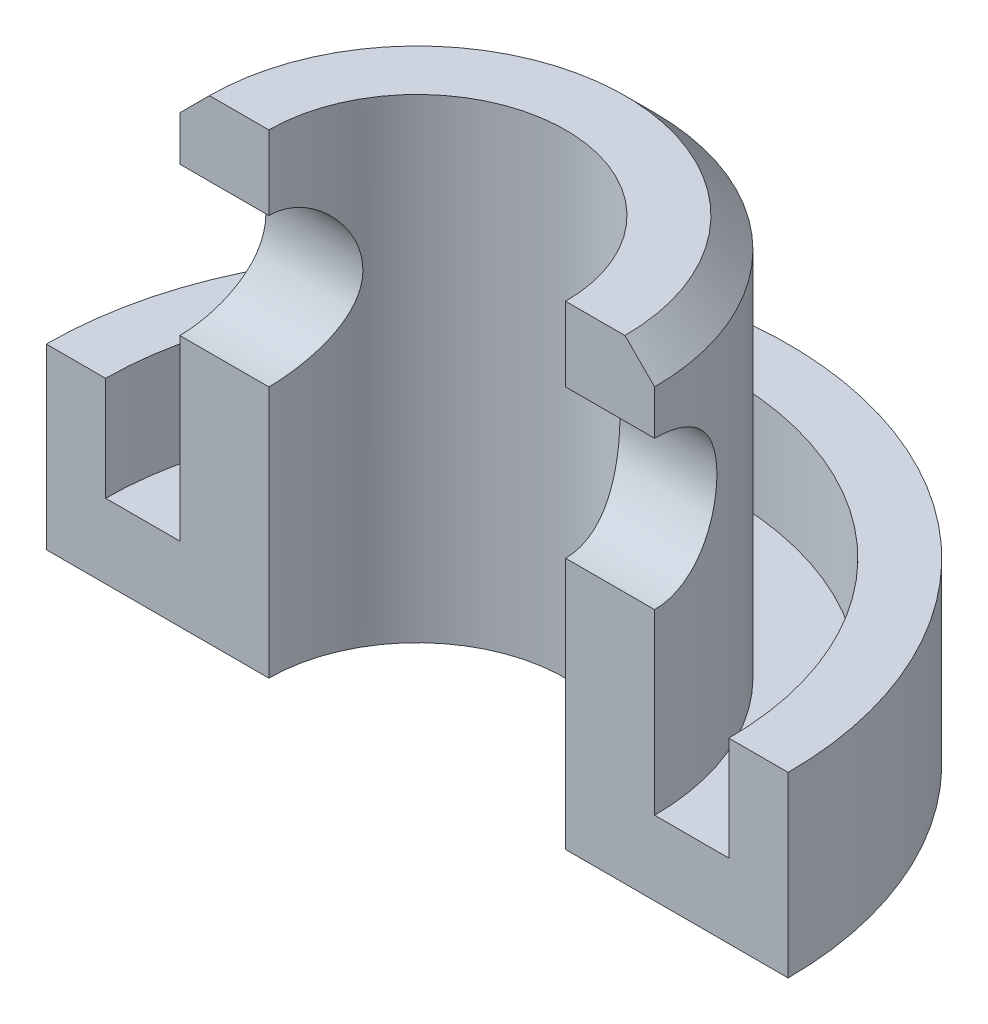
ISO-10303-21;
HEADER;
FILE_DESCRIPTION(('STEP AP214'),'2;1');
FILE_NAME('part.step','',(''),(''),'','','');
FILE_SCHEMA(('AUTOMOTIVE_DESIGN { 1 0 10303 214 1 1 1 1 }'));
ENDSEC;
DATA;
#1=APPLICATION_CONTEXT('core data for automotive mechanical design processes');
#2=APPLICATION_PROTOCOL_DEFINITION('international standard','automotive_design',2000,#1);
#3=PRODUCT_CONTEXT('',#1,'mechanical');
#4=PRODUCT('Part','Part','',(#3));
#5=PRODUCT_RELATED_PRODUCT_CATEGORY('part','',(#4));
#6=PRODUCT_DEFINITION_FORMATION('','',#4);
#7=PRODUCT_DEFINITION_CONTEXT('part definition',#1,'design');
#8=PRODUCT_DEFINITION('design','',#6,#7);
#9=PRODUCT_DEFINITION_SHAPE('','',#8);
#10=(LENGTH_UNIT() NAMED_UNIT(*) SI_UNIT(.MILLI.,.METRE.));
#11=(NAMED_UNIT(*) PLANE_ANGLE_UNIT() SI_UNIT($,.RADIAN.));
#12=(NAMED_UNIT(*) SI_UNIT($,.STERADIAN.) SOLID_ANGLE_UNIT());
#13=UNCERTAINTY_MEASURE_WITH_UNIT(LENGTH_MEASURE(1.E-05),#10,'distance_accuracy_value','');
#14=(GEOMETRIC_REPRESENTATION_CONTEXT(3) GLOBAL_UNCERTAINTY_ASSIGNED_CONTEXT((#13)) GLOBAL_UNIT_ASSIGNED_CONTEXT((#10,
#11,#12)) REPRESENTATION_CONTEXT('',''));
#15=CARTESIAN_POINT('',(0.,0.,0.));
#16=DIRECTION('',(0.,0.,1.));
#17=DIRECTION('',(1.,0.,0.));
#18=AXIS2_PLACEMENT_3D('',#15,#16,#17);
#19=CARTESIAN_POINT('',(-28.7272249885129,169.018039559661,0.));
#20=DIRECTION('',(0.,0.,-1.));
#21=DIRECTION('',(-1.,0.,0.));
#22=AXIS2_PLACEMENT_3D('',#19,#20,#21);
#23=PLANE('',#22);
#24=DIRECTION('',(0.,-1.,0.));
#25=VECTOR('',#24,1.);
#26=CARTESIAN_POINT('',(16.,0.,0.));
#27=LINE('',#26,#25);
#28=CARTESIAN_POINT('',(16.,30.,0.));
#29=VERTEX_POINT('',#28);
#30=CARTESIAN_POINT('',(16.,27.,0.));
#31=VERTEX_POINT('',#30);
#32=EDGE_CURVE('E249',#29,#31,#27,.T.);
#33=ORIENTED_EDGE('',*,*,#32,.F.);
#34=DIRECTION('',(0.707106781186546,-0.707106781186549,0.));
#35=VECTOR('',#34,1.);
#36=CARTESIAN_POINT('',(0.,46.0000000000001,0.));
#37=LINE('',#36,#35);
#38=CARTESIAN_POINT('',(14.,32.,0.));
#39=VERTEX_POINT('',#38);
#40=EDGE_CURVE('E257',#39,#29,#37,.T.);
#41=ORIENTED_EDGE('',*,*,#40,.F.);
#42=DIRECTION('',(1.,0.,0.));
#43=VECTOR('',#42,1.);
#44=CARTESIAN_POINT('',(-14.,32.,0.));
#45=LINE('',#44,#43);
#46=CARTESIAN_POINT('',(9.99999999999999,32.,0.));
#47=VERTEX_POINT('',#46);
#48=EDGE_CURVE('E244',#47,#39,#45,.T.);
#49=ORIENTED_EDGE('',*,*,#48,.F.);
#50=DIRECTION('',(0.,-1.,0.));
#51=VECTOR('',#50,1.);
#52=CARTESIAN_POINT('',(9.99999999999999,0.,0.));
#53=LINE('',#52,#51);
#54=CARTESIAN_POINT('',(10.0000000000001,27.0000000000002,0.));
#55=VERTEX_POINT('',#54);
#56=EDGE_CURVE('E49',#55,#47,#53,.F.);
#57=ORIENTED_EDGE('',*,*,#56,.F.);
#58=DIRECTION('',(1.,0.,0.));
#59=VECTOR('',#58,1.);
#60=CARTESIAN_POINT('',(-25.,27.,0.));
#61=LINE('',#60,#59);
#62=EDGE_CURVE('E256',#31,#55,#61,.F.);
#63=ORIENTED_EDGE('',*,*,#62,.F.);
#64=EDGE_LOOP('',(#33,#41,#49,#57,#63));
#65=FACE_BOUND('',#64,.T.);
#66=ADVANCED_FACE('F26',(#65),#23,.F.);
#67=CARTESIAN_POINT('',(0.,0.,0.));
#68=DIRECTION('',(0.,-1.,0.));
#69=DIRECTION('',(0.,0.,-1.));
#70=AXIS2_PLACEMENT_3D('',#67,#68,#69);
#71=CYLINDRICAL_SURFACE('',#70,25.);
#72=CARTESIAN_POINT('',(0.,12.,0.));
#73=DIRECTION('',(0.,-1.,0.));
#74=DIRECTION('',(0.,0.,-1.));
#75=AXIS2_PLACEMENT_3D('',#72,#73,#74);
#76=CIRCLE('',#75,25.);
#77=CARTESIAN_POINT('',(-25.,12.,0.));
#78=VERTEX_POINT('',#77);
#79=CARTESIAN_POINT('',(25.,12.,0.));
#80=VERTEX_POINT('',#79);
#81=EDGE_CURVE('E130',#78,#80,#76,.T.);
#82=ORIENTED_EDGE('',*,*,#81,.T.);
#83=DIRECTION('',(0.,-1.,0.));
#84=VECTOR('',#83,1.);
#85=CARTESIAN_POINT('',(25.,0.,0.));
#86=LINE('',#85,#84);
#87=CARTESIAN_POINT('',(25.,0.,0.));
#88=VERTEX_POINT('',#87);
#89=EDGE_CURVE('E253',#80,#88,#86,.T.);
#90=ORIENTED_EDGE('',*,*,#89,.T.);
#91=CARTESIAN_POINT('',(0.,0.,0.));
#92=DIRECTION('',(0.,-1.,0.));
#93=DIRECTION('',(0.,0.,-1.));
#94=AXIS2_PLACEMENT_3D('',#91,#92,#93);
#95=CIRCLE('',#94,25.);
#96=CARTESIAN_POINT('',(-25.,0.,0.));
#97=VERTEX_POINT('',#96);
#98=EDGE_CURVE('E144',#97,#88,#95,.T.);
#99=ORIENTED_EDGE('',*,*,#98,.F.);
#100=DIRECTION('',(0.,-1.,0.));
#101=VECTOR('',#100,1.);
#102=CARTESIAN_POINT('',(-25.,0.,0.));
#103=LINE('',#102,#101);
#104=EDGE_CURVE('E234',#97,#78,#103,.F.);
#105=ORIENTED_EDGE('',*,*,#104,.T.);
#106=EDGE_LOOP('',(#82,#90,#99,#105));
#107=FACE_BOUND('',#106,.T.);
#108=ADVANCED_FACE('F28',(#107),#71,.T.);
#109=CARTESIAN_POINT('',(-25.,12.,0.));
#110=DIRECTION('',(0.,-1.,0.));
#111=DIRECTION('',(0.,0.,-1.));
#112=AXIS2_PLACEMENT_3D('',#109,#110,#111);
#113=PLANE('',#112);
#114=ORIENTED_EDGE('',*,*,#81,.F.);
#115=DIRECTION('',(1.,0.,0.));
#116=VECTOR('',#115,1.);
#117=CARTESIAN_POINT('',(-25.,12.,0.));
#118=LINE('',#117,#116);
#119=CARTESIAN_POINT('',(-21.,12.,0.));
#120=VERTEX_POINT('',#119);
#121=EDGE_CURVE('E231',#78,#120,#118,.T.);
#122=ORIENTED_EDGE('',*,*,#121,.T.);
#123=CARTESIAN_POINT('',(0.,12.,0.));
#124=DIRECTION('',(0.,-1.,0.));
#125=DIRECTION('',(0.,0.,-1.));
#126=AXIS2_PLACEMENT_3D('',#123,#124,#125);
#127=CIRCLE('',#126,21.);
#128=CARTESIAN_POINT('',(21.,12.,0.));
#129=VERTEX_POINT('',#128);
#130=EDGE_CURVE('E278',#120,#129,#127,.T.);
#131=ORIENTED_EDGE('',*,*,#130,.T.);
#132=EDGE_CURVE('E235',#129,#80,#118,.T.);
#133=ORIENTED_EDGE('',*,*,#132,.T.);
#134=EDGE_LOOP('',(#114,#122,#131,#133));
#135=FACE_BOUND('',#134,.T.);
#136=ADVANCED_FACE('F204',(#135),#113,.F.);
#137=CARTESIAN_POINT('',(0.,0.,0.));
#138=DIRECTION('',(0.,-1.,0.));
#139=DIRECTION('',(0.,0.,-1.));
#140=AXIS2_PLACEMENT_3D('',#137,#138,#139);
#141=CYLINDRICAL_SURFACE('',#140,21.);
#142=CARTESIAN_POINT('',(0.,5.,0.));
#143=DIRECTION('',(0.,-1.,0.));
#144=DIRECTION('',(0.,0.,-1.));
#145=AXIS2_PLACEMENT_3D('',#142,#143,#144);
#146=CIRCLE('',#145,21.);
#147=CARTESIAN_POINT('',(-21.,5.,0.));
#148=VERTEX_POINT('',#147);
#149=CARTESIAN_POINT('',(21.,5.,0.));
#150=VERTEX_POINT('',#149);
#151=EDGE_CURVE('E275',#148,#150,#146,.T.);
#152=ORIENTED_EDGE('',*,*,#151,.T.);
#153=DIRECTION('',(0.,-1.,0.));
#154=VECTOR('',#153,1.);
#155=CARTESIAN_POINT('',(21.,0.,0.));
#156=LINE('',#155,#154);
#157=EDGE_CURVE('E250',#150,#129,#156,.F.);
#158=ORIENTED_EDGE('',*,*,#157,.T.);
#159=ORIENTED_EDGE('',*,*,#130,.F.);
#160=DIRECTION('',(0.,-1.,0.));
#161=VECTOR('',#160,1.);
#162=CARTESIAN_POINT('',(-21.,0.,0.));
#163=LINE('',#162,#161);
#164=EDGE_CURVE('E227',#120,#148,#163,.T.);
#165=ORIENTED_EDGE('',*,*,#164,.T.);
#166=EDGE_LOOP('',(#152,#158,#159,#165));
#167=FACE_BOUND('',#166,.T.);
#168=ADVANCED_FACE('F288',(#167),#141,.F.);
#169=CARTESIAN_POINT('',(-21.,5.,0.));
#170=DIRECTION('',(0.,-1.,0.));
#171=DIRECTION('',(0.,0.,-1.));
#172=AXIS2_PLACEMENT_3D('',#169,#170,#171);
#173=PLANE('',#172);
#174=ORIENTED_EDGE('',*,*,#151,.F.);
#175=DIRECTION('',(1.,0.,0.));
#176=VECTOR('',#175,1.);
#177=CARTESIAN_POINT('',(-21.,5.,0.));
#178=LINE('',#177,#176);
#179=CARTESIAN_POINT('',(-16.,5.,0.));
#180=VERTEX_POINT('',#179);
#181=EDGE_CURVE('E140',#148,#180,#178,.T.);
#182=ORIENTED_EDGE('',*,*,#181,.T.);
#183=CARTESIAN_POINT('',(0.,5.,0.));
#184=DIRECTION('',(0.,-1.,0.));
#185=DIRECTION('',(0.,0.,-1.));
#186=AXIS2_PLACEMENT_3D('',#183,#184,#185);
#187=CIRCLE('',#186,16.);
#188=CARTESIAN_POINT('',(16.,5.,0.));
#189=VERTEX_POINT('',#188);
#190=EDGE_CURVE('E139',#180,#189,#187,.T.);
#191=ORIENTED_EDGE('',*,*,#190,.T.);
#192=EDGE_CURVE('E228',#189,#150,#178,.T.);
#193=ORIENTED_EDGE('',*,*,#192,.T.);
#194=EDGE_LOOP('',(#174,#182,#191,#193));
#195=FACE_BOUND('',#194,.T.);
#196=ADVANCED_FACE('F197',(#195),#173,.F.);
#197=CARTESIAN_POINT('',(0.,0.,0.));
#198=DIRECTION('',(0.,-1.,0.));
#199=DIRECTION('',(0.,0.,-1.));
#200=AXIS2_PLACEMENT_3D('',#197,#198,#199);
#201=CYLINDRICAL_SURFACE('',#200,16.);
#202=CARTESIAN_POINT('',(0.,30.,0.));
#203=DIRECTION('',(0.,-1.,0.));
#204=DIRECTION('',(0.,0.,-1.));
#205=AXIS2_PLACEMENT_3D('',#202,#203,#204);
#206=CIRCLE('',#205,16.);
#207=CARTESIAN_POINT('',(-16.,30.,0.));
#208=VERTEX_POINT('',#207);
#209=EDGE_CURVE('E270',#208,#29,#206,.T.);
#210=ORIENTED_EDGE('',*,*,#209,.T.);
#211=ORIENTED_EDGE('',*,*,#32,.T.);
#212=CARTESIAN_POINT('',(15.1986841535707,22.,-5.));
#213=CARTESIAN_POINT('',(15.1986858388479,21.7266118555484,-4.99999815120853));
#214=CARTESIAN_POINT('',(15.206141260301,21.4532049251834,-4.97750155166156));
#215=CARTESIAN_POINT('',(15.2350255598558,20.9144233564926,-4.8883670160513));
#216=CARTESIAN_POINT('',(15.2564582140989,20.6490509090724,-4.82171715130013));
#217=CARTESIAN_POINT('',(15.3106375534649,20.134220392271,-4.64679152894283));
#218=CARTESIAN_POINT('',(15.3433642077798,19.884735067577,-4.53858942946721));
#219=CARTESIAN_POINT('',(15.4164162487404,19.4073892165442,-4.28387656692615));
#220=CARTESIAN_POINT('',(15.4567429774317,19.1795325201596,-4.13735903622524));
#221=CARTESIAN_POINT('',(15.5420051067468,18.744084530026,-3.80478428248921));
#222=CARTESIAN_POINT('',(15.5870449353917,18.537345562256,-3.61763759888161));
#223=CARTESIAN_POINT('',(15.6757698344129,18.1576159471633,-3.21144818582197));
#224=CARTESIAN_POINT('',(15.7194547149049,17.9846300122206,-2.99240101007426));
#225=CARTESIAN_POINT('',(15.8017421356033,17.673555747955,-2.52250364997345));
#226=CARTESIAN_POINT('',(15.8402073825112,17.5363451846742,-2.27104622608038));
#227=CARTESIAN_POINT('',(15.9065020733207,17.3064958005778,-1.74721693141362));
#228=CARTESIAN_POINT('',(15.9343340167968,17.2138465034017,-1.47484999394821));
#229=CARTESIAN_POINT('',(15.9754870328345,17.0785954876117,-0.925857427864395));
#230=CARTESIAN_POINT('',(15.9892295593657,17.0345370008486,-0.649622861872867));
#231=CARTESIAN_POINT('',(16.0021438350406,16.9931026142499,-0.0933632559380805));
#232=CARTESIAN_POINT('',(16.0013188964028,16.9957161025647,0.186660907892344));
#233=CARTESIAN_POINT('',(15.9854846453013,17.0465931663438,0.732297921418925));
#234=CARTESIAN_POINT('',(15.9709660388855,17.093277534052,0.99807453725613));
#235=CARTESIAN_POINT('',(15.929979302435,17.2283799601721,1.51781225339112));
#236=CARTESIAN_POINT('',(15.9035103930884,17.3168007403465,1.77177258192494));
#237=CARTESIAN_POINT('',(15.8409383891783,17.5338807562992,2.26431241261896));
#238=CARTESIAN_POINT('',(15.8047213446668,17.663019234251,2.50266562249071));
#239=CARTESIAN_POINT('',(15.7264689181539,17.9574843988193,2.95481004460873));
#240=CARTESIAN_POINT('',(15.6844320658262,18.1228202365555,3.16859502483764));
#241=CARTESIAN_POINT('',(15.5969468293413,18.4930945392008,3.57495079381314));
#242=CARTESIAN_POINT('',(15.5514292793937,18.6993962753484,3.76626619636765));
#243=CARTESIAN_POINT('',(15.4636246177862,19.1415804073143,4.11195897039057));
#244=CARTESIAN_POINT('',(15.4213378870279,19.3774662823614,4.26633199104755));
#245=CARTESIAN_POINT('',(15.3444338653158,19.8756698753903,4.53521860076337));
#246=CARTESIAN_POINT('',(15.3099076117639,20.1382536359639,4.64926722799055));
#247=CARTESIAN_POINT('',(15.253501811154,20.680237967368,4.83113383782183));
#248=CARTESIAN_POINT('',(15.2316177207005,20.9596324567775,4.89896843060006));
#249=CARTESIAN_POINT('',(15.2039825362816,21.5152798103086,4.9840594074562));
#250=CARTESIAN_POINT('',(15.1976186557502,21.7912079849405,5.00323817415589));
#251=CARTESIAN_POINT('',(15.200043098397,22.3423589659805,4.99586977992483));
#252=CARTESIAN_POINT('',(15.2088290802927,22.6175818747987,4.96932968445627));
#253=CARTESIAN_POINT('',(15.2399582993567,23.1512331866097,4.87299494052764));
#254=CARTESIAN_POINT('',(15.2619021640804,23.4099170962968,4.80447324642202));
#255=CARTESIAN_POINT('',(15.3164514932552,23.9120871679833,4.62761494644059));
#256=CARTESIAN_POINT('',(15.3490586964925,24.1555708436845,4.51927184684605));
#257=CARTESIAN_POINT('',(15.4224215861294,24.6281564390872,4.26230042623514));
#258=CARTESIAN_POINT('',(15.4633841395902,24.8566456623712,4.11260589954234));
#259=CARTESIAN_POINT('',(15.5484139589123,25.2859613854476,3.77842563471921));
#260=CARTESIAN_POINT('',(15.5924820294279,25.4867806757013,3.59393085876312));
#261=CARTESIAN_POINT('',(15.6809675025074,25.8636414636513,3.18629179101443));
#262=CARTESIAN_POINT('',(15.7253236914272,26.0383111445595,2.96186259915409));
#263=CARTESIAN_POINT('',(15.8075623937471,26.347564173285,2.48580618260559));
#264=CARTESIAN_POINT('',(15.8454452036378,26.4821493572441,2.23418020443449));
#265=CARTESIAN_POINT('',(15.9102524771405,26.7061222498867,1.71242209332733));
#266=CARTESIAN_POINT('',(15.937255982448,26.7958371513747,1.44244073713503));
#267=CARTESIAN_POINT('',(15.9776097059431,26.9282901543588,0.890229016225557));
#268=CARTESIAN_POINT('',(15.9909641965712,26.971042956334,0.608002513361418));
#269=CARTESIAN_POINT('',(16.0022321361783,27.0071640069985,0.0519397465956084));
#270=CARTESIAN_POINT('',(16.0007651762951,27.0025138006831,-0.22175676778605));
#271=CARTESIAN_POINT('',(15.9840391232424,26.9487527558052,-0.764292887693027));
#272=CARTESIAN_POINT('',(15.9687809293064,26.899644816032,-1.03313280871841));
#273=CARTESIAN_POINT('',(15.9263828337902,26.7596239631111,-1.55502047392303));
#274=CARTESIAN_POINT('',(15.899393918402,26.6692415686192,-1.80822367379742));
#275=CARTESIAN_POINT('',(15.8363178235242,26.4497166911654,-2.29599370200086));
#276=CARTESIAN_POINT('',(15.8002290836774,26.3205675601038,-2.53055732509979));
#277=CARTESIAN_POINT('',(15.7211958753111,26.0221089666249,-2.98304677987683));
#278=CARTESIAN_POINT('',(15.6780603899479,25.851585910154,-3.20013842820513));
#279=CARTESIAN_POINT('',(15.590349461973,25.4773604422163,-3.6032831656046));
#280=CARTESIAN_POINT('',(15.5457735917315,25.2736481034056,-3.78932693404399));
#281=CARTESIAN_POINT('',(15.4584757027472,24.8307371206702,-4.13131463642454));
#282=CARTESIAN_POINT('',(15.4158640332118,24.5905863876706,-4.28605711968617));
#283=CARTESIAN_POINT('',(15.3392050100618,24.0864075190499,-4.5528188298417));
#284=CARTESIAN_POINT('',(15.3051541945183,23.8223890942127,-4.66485533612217));
#285=CARTESIAN_POINT('',(15.2522624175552,23.3011095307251,-4.83484721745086));
#286=CARTESIAN_POINT('',(15.2323726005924,23.0451898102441,-4.89659759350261));
#287=CARTESIAN_POINT('',(15.2055842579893,22.5261846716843,-4.97916983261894));
#288=CARTESIAN_POINT('',(15.1986825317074,22.2631010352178,-5.00000177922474));
#289=CARTESIAN_POINT('',(15.1986841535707,22.,-5.));
#290=B_SPLINE_CURVE_WITH_KNOTS('',3,(#212,#213,#214,#215,#216,#217,#218,#219,#220,#221,#222,
#223,#224,#225,#226,#227,#228,#229,#230,#231,#232,#233,#234,#235,#236,#237,#238,#239,#240,#241,
#242,#243,#244,#245,#246,#247,#248,#249,#250,#251,#252,#253,#254,#255,#256,#257,#258,#259,#260,
#261,#262,#263,#264,#265,#266,#267,#268,#269,#270,#271,#272,#273,#274,#275,#276,#277,#278,#279,
#280,#281,#282,#283,#284,#285,#286,#287,#288,#289),.UNSPECIFIED.,.T.,.F.,(4,2,2,2,2,2,2,2,2,2,2,
2,2,2,2,2,2,2,2,2,2,2,2,2,2,2,2,2,2,2,2,2,2,2,2,2,2,2,4),(0.,0.819192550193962,1.63860650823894,
2.45657457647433,3.27468721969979,4.11828322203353,4.96199691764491,5.82479287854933,
6.68738589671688,7.52334891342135,8.35912185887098,9.16603931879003,9.97300940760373,
10.7898561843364,11.6069097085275,12.4580135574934,13.309217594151,14.1699388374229,
15.0303505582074,15.8561973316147,16.6819164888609,17.4837588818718,18.2857320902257,
19.1107045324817,19.9358915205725,20.7952775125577,21.6546241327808,22.5076095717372,
23.3603279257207,24.1775520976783,24.9947229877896,25.8016738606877,26.6087631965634,
27.4432277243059,28.2779423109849,29.1403118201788,30.002332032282,30.7908941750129,
31.5792619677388),.UNSPECIFIED.);
#291=CARTESIAN_POINT('',(16.,17.,0.));
#292=VERTEX_POINT('',#291);
#293=EDGE_CURVE('E145',#31,#292,#290,.T.);
#294=ORIENTED_EDGE('',*,*,#293,.T.);
#295=EDGE_CURVE('E41',#292,#189,#27,.T.);
#296=ORIENTED_EDGE('',*,*,#295,.T.);
#297=ORIENTED_EDGE('',*,*,#190,.F.);
#298=DIRECTION('',(0.,-1.,0.));
#299=VECTOR('',#298,1.);
#300=CARTESIAN_POINT('',(-16.,0.,0.));
#301=LINE('',#300,#299);
#302=CARTESIAN_POINT('',(-16.,17.,0.));
#303=VERTEX_POINT('',#302);
#304=EDGE_CURVE('E122',#180,#303,#301,.F.);
#305=ORIENTED_EDGE('',*,*,#304,.T.);
#306=CARTESIAN_POINT('',(-15.1986841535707,22.,-5.));
#307=CARTESIAN_POINT('',(-15.1986858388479,22.2733881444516,-4.99999815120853));
#308=CARTESIAN_POINT('',(-15.206141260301,22.5467950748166,-4.97750155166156));
#309=CARTESIAN_POINT('',(-15.2350255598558,23.0855766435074,-4.8883670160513));
#310=CARTESIAN_POINT('',(-15.2564582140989,23.3509490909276,-4.82171715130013));
#311=CARTESIAN_POINT('',(-15.3106375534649,23.865779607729,-4.64679152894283));
#312=CARTESIAN_POINT('',(-15.3433642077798,24.115264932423,-4.53858942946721));
#313=CARTESIAN_POINT('',(-15.4164162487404,24.5926107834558,-4.28387656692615));
#314=CARTESIAN_POINT('',(-15.4567429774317,24.8204674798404,-4.13735903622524));
#315=CARTESIAN_POINT('',(-15.5420051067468,25.255915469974,-3.80478428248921));
#316=CARTESIAN_POINT('',(-15.5870449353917,25.462654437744,-3.61763759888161));
#317=CARTESIAN_POINT('',(-15.6757698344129,25.8423840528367,-3.21144818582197));
#318=CARTESIAN_POINT('',(-15.7194547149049,26.0153699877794,-2.99240101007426));
#319=CARTESIAN_POINT('',(-15.8017421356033,26.326444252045,-2.52250364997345));
#320=CARTESIAN_POINT('',(-15.8402073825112,26.4636548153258,-2.27104622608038));
#321=CARTESIAN_POINT('',(-15.9065020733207,26.6935041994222,-1.74721693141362));
#322=CARTESIAN_POINT('',(-15.9343340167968,26.7861534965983,-1.47484999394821));
#323=CARTESIAN_POINT('',(-15.9754870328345,26.9214045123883,-0.925857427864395));
#324=CARTESIAN_POINT('',(-15.9892295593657,26.9654629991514,-0.649622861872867));
#325=CARTESIAN_POINT('',(-16.0021438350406,27.0068973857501,-0.0933632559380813));
#326=CARTESIAN_POINT('',(-16.0013188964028,27.0042838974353,0.186660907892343));
#327=CARTESIAN_POINT('',(-15.9854846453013,26.9534068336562,0.732297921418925));
#328=CARTESIAN_POINT('',(-15.9709660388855,26.906722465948,0.99807453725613));
#329=CARTESIAN_POINT('',(-15.929979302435,26.7716200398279,1.51781225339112));
#330=CARTESIAN_POINT('',(-15.9035103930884,26.6831992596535,1.77177258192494));
#331=CARTESIAN_POINT('',(-15.8409383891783,26.4661192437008,2.26431241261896));
#332=CARTESIAN_POINT('',(-15.8047213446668,26.336980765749,2.50266562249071));
#333=CARTESIAN_POINT('',(-15.7264689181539,26.0425156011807,2.95481004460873));
#334=CARTESIAN_POINT('',(-15.6844320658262,25.8771797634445,3.16859502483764));
#335=CARTESIAN_POINT('',(-15.5969468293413,25.5069054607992,3.57495079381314));
#336=CARTESIAN_POINT('',(-15.5514292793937,25.3006037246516,3.76626619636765));
#337=CARTESIAN_POINT('',(-15.4636246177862,24.8584195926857,4.11195897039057));
#338=CARTESIAN_POINT('',(-15.4213378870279,24.6225337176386,4.26633199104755));
#339=CARTESIAN_POINT('',(-15.3444338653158,24.1243301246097,4.53521860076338));
#340=CARTESIAN_POINT('',(-15.3099076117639,23.8617463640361,4.64926722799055));
#341=CARTESIAN_POINT('',(-15.253501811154,23.319762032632,4.83113383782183));
#342=CARTESIAN_POINT('',(-15.2316177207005,23.0403675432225,4.89896843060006));
#343=CARTESIAN_POINT('',(-15.2039825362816,22.4847201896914,4.9840594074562));
#344=CARTESIAN_POINT('',(-15.1976186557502,22.2087920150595,5.00323817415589));
#345=CARTESIAN_POINT('',(-15.200043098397,21.6576410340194,4.99586977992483));
#346=CARTESIAN_POINT('',(-15.2088290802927,21.3824181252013,4.96932968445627));
#347=CARTESIAN_POINT('',(-15.2399582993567,20.8487668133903,4.87299494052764));
#348=CARTESIAN_POINT('',(-15.2619021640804,20.5900829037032,4.80447324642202));
#349=CARTESIAN_POINT('',(-15.3164514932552,20.0879128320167,4.62761494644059));
#350=CARTESIAN_POINT('',(-15.3490586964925,19.8444291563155,4.51927184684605));
#351=CARTESIAN_POINT('',(-15.4224215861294,19.3718435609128,4.26230042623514));
#352=CARTESIAN_POINT('',(-15.4633841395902,19.1433543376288,4.11260589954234));
#353=CARTESIAN_POINT('',(-15.5484139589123,18.7140386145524,3.77842563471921));
#354=CARTESIAN_POINT('',(-15.5924820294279,18.5132193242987,3.59393085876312));
#355=CARTESIAN_POINT('',(-15.6809675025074,18.1363585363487,3.18629179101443));
#356=CARTESIAN_POINT('',(-15.7253236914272,17.9616888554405,2.96186259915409));
#357=CARTESIAN_POINT('',(-15.8075623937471,17.652435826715,2.48580618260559));
#358=CARTESIAN_POINT('',(-15.8454452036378,17.5178506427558,2.23418020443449));
#359=CARTESIAN_POINT('',(-15.9102524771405,17.2938777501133,1.71242209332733));
#360=CARTESIAN_POINT('',(-15.937255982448,17.2041628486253,1.44244073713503));
#361=CARTESIAN_POINT('',(-15.9776097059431,17.0717098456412,0.890229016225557));
#362=CARTESIAN_POINT('',(-15.9909641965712,17.028957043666,0.608002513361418));
#363=CARTESIAN_POINT('',(-16.0022321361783,16.9928359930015,0.0519397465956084));
#364=CARTESIAN_POINT('',(-16.0007651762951,16.9974861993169,-0.22175676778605));
#365=CARTESIAN_POINT('',(-15.9840391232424,17.0512472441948,-0.764292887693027));
#366=CARTESIAN_POINT('',(-15.9687809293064,17.100355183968,-1.03313280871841));
#367=CARTESIAN_POINT('',(-15.9263828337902,17.2403760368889,-1.55502047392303));
#368=CARTESIAN_POINT('',(-15.899393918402,17.3307584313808,-1.80822367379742));
#369=CARTESIAN_POINT('',(-15.8363178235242,17.5502833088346,-2.29599370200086));
#370=CARTESIAN_POINT('',(-15.8002290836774,17.6794324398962,-2.53055732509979));
#371=CARTESIAN_POINT('',(-15.7211958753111,17.9778910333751,-2.98304677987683));
#372=CARTESIAN_POINT('',(-15.6780603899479,18.148414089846,-3.20013842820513));
#373=CARTESIAN_POINT('',(-15.590349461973,18.5226395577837,-3.6032831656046));
#374=CARTESIAN_POINT('',(-15.5457735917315,18.7263518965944,-3.78932693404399));
#375=CARTESIAN_POINT('',(-15.4584757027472,19.1692628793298,-4.13131463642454));
#376=CARTESIAN_POINT('',(-15.4158640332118,19.4094136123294,-4.28605711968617));
#377=CARTESIAN_POINT('',(-15.3392050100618,19.9135924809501,-4.5528188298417));
#378=CARTESIAN_POINT('',(-15.3051541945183,20.1776109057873,-4.66485533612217));
#379=CARTESIAN_POINT('',(-15.2522624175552,20.6988904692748,-4.83484721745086));
#380=CARTESIAN_POINT('',(-15.2323726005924,20.9548101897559,-4.89659759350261));
#381=CARTESIAN_POINT('',(-15.2055842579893,21.4738153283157,-4.97916983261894));
#382=CARTESIAN_POINT('',(-15.1986825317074,21.7368989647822,-5.00000177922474));
#383=CARTESIAN_POINT('',(-15.1986841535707,22.,-5.));
#384=B_SPLINE_CURVE_WITH_KNOTS('',3,(#306,#307,#308,#309,#310,#311,#312,#313,#314,#315,#316,
#317,#318,#319,#320,#321,#322,#323,#324,#325,#326,#327,#328,#329,#330,#331,#332,#333,#334,#335,
#336,#337,#338,#339,#340,#341,#342,#343,#344,#345,#346,#347,#348,#349,#350,#351,#352,#353,#354,
#355,#356,#357,#358,#359,#360,#361,#362,#363,#364,#365,#366,#367,#368,#369,#370,#371,#372,#373,
#374,#375,#376,#377,#378,#379,#380,#381,#382,#383),.UNSPECIFIED.,.T.,.F.,(4,2,2,2,2,2,2,2,2,2,2,
2,2,2,2,2,2,2,2,2,2,2,2,2,2,2,2,2,2,2,2,2,2,2,2,2,2,2,4),(0.,0.819192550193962,1.63860650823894,
2.45657457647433,3.27468721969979,4.11828322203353,4.96199691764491,5.82479287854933,
6.68738589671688,7.52334891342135,8.35912185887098,9.16603931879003,9.97300940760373,
10.7898561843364,11.6069097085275,12.4580135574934,13.309217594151,14.1699388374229,
15.0303505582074,15.8561973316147,16.6819164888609,17.4837588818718,18.2857320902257,
19.1107045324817,19.9358915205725,20.7952775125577,21.6546241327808,22.5076095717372,
23.3603279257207,24.1775520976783,24.9947229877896,25.8016738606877,26.6087631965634,
27.4432277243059,28.2779423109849,29.1403118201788,30.002332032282,30.7908941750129,
31.5792619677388),.UNSPECIFIED.);
#385=CARTESIAN_POINT('',(-16.,27.,0.));
#386=VERTEX_POINT('',#385);
#387=EDGE_CURVE('E137',#303,#386,#384,.T.);
#388=ORIENTED_EDGE('',*,*,#387,.T.);
#389=EDGE_CURVE('E142',#386,#208,#301,.F.);
#390=ORIENTED_EDGE('',*,*,#389,.T.);
#391=EDGE_LOOP('',(#210,#211,#294,#296,#297,#305,#388,#390));
#392=FACE_BOUND('',#391,.T.);
#393=ADVANCED_FACE('F135',(#392),#201,.T.);
#394=CARTESIAN_POINT('',(0.,32.,0.));
#395=DIRECTION('',(0.,-1.,0.));
#396=DIRECTION('',(0.,0.,-1.));
#397=AXIS2_PLACEMENT_3D('',#394,#395,#396);
#398=CONICAL_SURFACE('',#397,14.,0.785398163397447);
#399=CARTESIAN_POINT('',(0.,32.,0.));
#400=DIRECTION('',(0.,-1.,0.));
#401=DIRECTION('',(0.,0.,-1.));
#402=AXIS2_PLACEMENT_3D('',#399,#400,#401);
#403=CIRCLE('',#402,14.);
#404=CARTESIAN_POINT('',(-14.,32.,0.));
#405=VERTEX_POINT('',#404);
#406=EDGE_CURVE('E268',#405,#39,#403,.T.);
#407=ORIENTED_EDGE('',*,*,#406,.T.);
#408=ORIENTED_EDGE('',*,*,#40,.T.);
#409=ORIENTED_EDGE('',*,*,#209,.F.);
#410=DIRECTION('',(0.707106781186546,0.707106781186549,0.));
#411=VECTOR('',#410,1.);
#412=CARTESIAN_POINT('',(0.,46.0000000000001,0.));
#413=LINE('',#412,#411);
#414=EDGE_CURVE('E217',#208,#405,#413,.T.);
#415=ORIENTED_EDGE('',*,*,#414,.T.);
#416=EDGE_LOOP('',(#407,#408,#409,#415));
#417=FACE_BOUND('',#416,.T.);
#418=ADVANCED_FACE('F190',(#417),#398,.T.);
#419=CARTESIAN_POINT('',(-14.,32.,0.));
#420=DIRECTION('',(0.,-1.,0.));
#421=DIRECTION('',(0.,0.,-1.));
#422=AXIS2_PLACEMENT_3D('',#419,#420,#421);
#423=PLANE('',#422);
#424=ORIENTED_EDGE('',*,*,#406,.F.);
#425=CARTESIAN_POINT('',(-9.99999999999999,32.,0.));
#426=VERTEX_POINT('',#425);
#427=EDGE_CURVE('E222',#405,#426,#45,.T.);
#428=ORIENTED_EDGE('',*,*,#427,.T.);
#429=CARTESIAN_POINT('',(0.,32.,0.));
#430=DIRECTION('',(0.,-1.,0.));
#431=DIRECTION('',(0.,0.,-1.));
#432=AXIS2_PLACEMENT_3D('',#429,#430,#431);
#433=CIRCLE('',#432,10.);
#434=EDGE_CURVE('E266',#426,#47,#433,.T.);
#435=ORIENTED_EDGE('',*,*,#434,.T.);
#436=ORIENTED_EDGE('',*,*,#48,.T.);
#437=EDGE_LOOP('',(#424,#428,#435,#436));
#438=FACE_BOUND('',#437,.T.);
#439=ADVANCED_FACE('F186',(#438),#423,.F.);
#440=CARTESIAN_POINT('',(0.,0.,0.));
#441=DIRECTION('',(0.,-1.,0.));
#442=DIRECTION('',(0.,0.,-1.));
#443=AXIS2_PLACEMENT_3D('',#440,#441,#442);
#444=CYLINDRICAL_SURFACE('',#443,9.99999999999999);
#445=CARTESIAN_POINT('',(0.,0.,0.));
#446=DIRECTION('',(0.,-1.,0.));
#447=DIRECTION('',(0.,0.,-1.));
#448=AXIS2_PLACEMENT_3D('',#445,#446,#447);
#449=CIRCLE('',#448,9.99999999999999);
#450=CARTESIAN_POINT('',(-9.99999999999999,0.,0.));
#451=VERTEX_POINT('',#450);
#452=CARTESIAN_POINT('',(9.99999999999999,0.,0.));
#453=VERTEX_POINT('',#452);
#454=EDGE_CURVE('E148',#451,#453,#449,.T.);
#455=ORIENTED_EDGE('',*,*,#454,.T.);
#456=CARTESIAN_POINT('',(9.99999999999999,17.,0.));
#457=VERTEX_POINT('',#456);
#458=EDGE_CURVE('E220',#453,#457,#53,.F.);
#459=ORIENTED_EDGE('',*,*,#458,.T.);
#460=CARTESIAN_POINT('',(8.66025403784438,22.,-5.));
#461=CARTESIAN_POINT('',(8.66025482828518,22.1303316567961,-4.99999937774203));
#462=CARTESIAN_POINT('',(8.6632063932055,22.2606749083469,-4.99489703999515));
#463=CARTESIAN_POINT('',(8.67490215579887,22.5203552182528,-4.97455590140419));
#464=CARTESIAN_POINT('',(8.68364905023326,22.6496917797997,-4.95931238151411));
#465=CARTESIAN_POINT('',(8.7066291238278,22.9065135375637,-4.91885673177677));
#466=CARTESIAN_POINT('',(8.72087090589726,23.033995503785,-4.89362896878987));
#467=CARTESIAN_POINT('',(8.75432466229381,23.2860174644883,-4.83352579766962));
#468=CARTESIAN_POINT('',(8.7735387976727,23.410556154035,-4.79864619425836));
#469=CARTESIAN_POINT('',(8.83745677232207,23.7771112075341,-4.6805346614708));
#470=CARTESIAN_POINT('',(8.88859880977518,24.0137323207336,-4.58356144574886));
#471=CARTESIAN_POINT('',(9.00213659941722,24.4671619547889,-4.35632594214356));
#472=CARTESIAN_POINT('',(9.06453296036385,24.6839694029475,-4.22606185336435));
#473=CARTESIAN_POINT('',(9.19984032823,25.1115106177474,-3.92334549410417));
#474=CARTESIAN_POINT('',(9.27319410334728,25.3202685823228,-3.74829976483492));
#475=CARTESIAN_POINT('',(9.41860822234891,25.7070690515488,-3.36622943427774));
#476=CARTESIAN_POINT('',(9.49066790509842,25.8850962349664,-3.15918897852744));
#477=CARTESIAN_POINT('',(9.59484443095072,26.1312264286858,-2.82033206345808));
#478=CARTESIAN_POINT('',(9.6299355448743,26.2119131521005,-2.69838192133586));
#479=CARTESIAN_POINT('',(9.69680156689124,26.3626286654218,-2.44722131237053));
#480=CARTESIAN_POINT('',(9.7285777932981,26.4326616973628,-2.31801376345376));
#481=CARTESIAN_POINT('',(9.78789520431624,26.5613762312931,-2.05317391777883));
#482=CARTESIAN_POINT('',(9.81543747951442,26.6200606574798,-1.91754328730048));
#483=CARTESIAN_POINT('',(9.86547242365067,26.7254310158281,-1.64079696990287));
#484=CARTESIAN_POINT('',(9.88796562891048,26.7721182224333,-1.49968186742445));
#485=CARTESIAN_POINT('',(9.92580359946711,26.8500155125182,-1.2233043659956));
#486=CARTESIAN_POINT('',(9.94154295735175,26.8820901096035,-1.08833937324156));
#487=CARTESIAN_POINT('',(9.96761571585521,26.9349664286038,-0.815709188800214));
#488=CARTESIAN_POINT('',(9.97794964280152,26.9557692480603,-0.678044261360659));
#489=CARTESIAN_POINT('',(9.99290900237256,26.9858199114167,-0.40121705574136));
#490=CARTESIAN_POINT('',(9.99753719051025,26.9950733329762,-0.262055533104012));
#491=CARTESIAN_POINT('',(10.0009568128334,27.0019143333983,0.0166220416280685));
#492=CARTESIAN_POINT('',(9.99974860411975,26.9995026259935,0.156138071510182));
#493=CARTESIAN_POINT('',(9.99189263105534,26.9837693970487,0.422158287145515));
#494=CARTESIAN_POINT('',(9.9857287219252,26.9714182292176,0.548735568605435));
#495=CARTESIAN_POINT('',(9.9687211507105,26.937167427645,0.800312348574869));
#496=CARTESIAN_POINT('',(9.95787601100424,26.915264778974,0.925311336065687));
#497=CARTESIAN_POINT('',(9.93176736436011,26.8621537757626,1.17280363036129));
#498=CARTESIAN_POINT('',(9.91650533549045,26.8309485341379,1.29529776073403));
#499=CARTESIAN_POINT('',(9.88192155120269,26.7595523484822,1.53706747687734));
#500=CARTESIAN_POINT('',(9.86259824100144,26.7193579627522,1.6563418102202));
#501=CARTESIAN_POINT('',(9.79859222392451,26.5846254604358,2.01140340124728));
#502=CARTESIAN_POINT('',(9.74822622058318,26.4766310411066,2.24122720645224));
#503=CARTESIAN_POINT('',(9.63687815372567,26.2286703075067,2.67992393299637));
#504=CARTESIAN_POINT('',(9.57589229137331,26.088692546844,2.88878931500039));
#505=CARTESIAN_POINT('',(9.44222356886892,25.7655365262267,3.30085071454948));
#506=CARTESIAN_POINT('',(9.36897995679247,25.5795253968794,3.50164452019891));
#507=CARTESIAN_POINT('',(9.22270586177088,25.1770108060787,3.87054772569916));
#508=CARTESIAN_POINT('',(9.14967558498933,24.9604841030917,4.03863197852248));
#509=CARTESIAN_POINT('',(9.04390911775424,24.6088064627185,4.2679539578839));
#510=CARTESIAN_POINT('',(9.00829977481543,24.4829490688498,4.34240098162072));
#511=CARTESIAN_POINT('',(8.94051483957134,24.2244861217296,4.48030007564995));
#512=CARTESIAN_POINT('',(8.90833780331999,24.0918834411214,4.54375677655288));
#513=CARTESIAN_POINT('',(8.84860631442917,23.8207965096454,4.65901104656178));
#514=CARTESIAN_POINT('',(8.82104906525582,23.6823158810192,4.71081567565));
#515=CARTESIAN_POINT('',(8.7716484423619,23.4003786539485,4.80217514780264));
#516=CARTESIAN_POINT('',(8.74980428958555,23.2569227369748,4.84173166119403));
#517=CARTESIAN_POINT('',(8.71426171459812,22.9777430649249,4.90539138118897));
#518=CARTESIAN_POINT('',(8.7000553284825,22.8423062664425,4.93047005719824));
#519=CARTESIAN_POINT('',(8.67788216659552,22.5693280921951,4.96939299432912));
#520=CARTESIAN_POINT('',(8.6699146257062,22.4317869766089,4.98323863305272));
#521=CARTESIAN_POINT('',(8.66056020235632,22.1558845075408,4.99947854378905));
#522=CARTESIAN_POINT('',(8.65916956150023,22.01752366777,5.00187935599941));
#523=CARTESIAN_POINT('',(8.66301922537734,21.7411790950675,4.99520900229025));
#524=CARTESIAN_POINT('',(8.66825908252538,21.6031953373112,4.98613861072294));
#525=CARTESIAN_POINT('',(8.68421505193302,21.3439119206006,4.95828928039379));
#526=CARTESIAN_POINT('',(8.69426699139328,21.2224432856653,4.94068517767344));
#527=CARTESIAN_POINT('',(8.71910498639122,20.9815824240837,4.89671673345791));
#528=CARTESIAN_POINT('',(8.7338925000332,20.8621908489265,4.87034969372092));
#529=CARTESIAN_POINT('',(8.78469607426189,20.5082899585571,4.77850297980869));
#530=CARTESIAN_POINT('',(8.82716454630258,20.2778857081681,4.7002591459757));
#531=CARTESIAN_POINT('',(8.92681241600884,19.8229067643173,4.50823244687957));
#532=CARTESIAN_POINT('',(8.98458205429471,19.5990963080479,4.39297142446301));
#533=CARTESIAN_POINT('',(9.10780608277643,19.1726622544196,4.1314342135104));
#534=CARTESIAN_POINT('',(9.17326441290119,18.9700496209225,3.98514209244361));
#535=CARTESIAN_POINT('',(9.31439795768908,18.5651085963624,3.64419701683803));
#536=CARTESIAN_POINT('',(9.39032093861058,18.3660355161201,3.44577250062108));
#537=CARTESIAN_POINT('',(9.5367199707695,18.0029175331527,3.01697632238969));
#538=CARTESIAN_POINT('',(9.60719417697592,17.8388844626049,2.78659391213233));
#539=CARTESIAN_POINT('',(9.70419418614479,17.6209905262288,2.41774074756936));
#540=CARTESIAN_POINT('',(9.73542921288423,17.5523379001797,2.28903769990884));
#541=CARTESIAN_POINT('',(9.79367711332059,17.4262434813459,2.02535752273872));
#542=CARTESIAN_POINT('',(9.82069185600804,17.3687967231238,1.89038320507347));
#543=CARTESIAN_POINT('',(9.86968940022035,17.2657820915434,1.61516754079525));
#544=CARTESIAN_POINT('',(9.89167460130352,17.2202085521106,1.47492874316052));
#545=CARTESIAN_POINT('',(9.9299508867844,17.1414909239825,1.19024723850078));
#546=CARTESIAN_POINT('',(9.9462426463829,17.1083453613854,1.04580503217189));
#547=CARTESIAN_POINT('',(9.97139931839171,17.0574049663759,0.767401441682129));
#548=CARTESIAN_POINT('',(9.98080865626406,17.0384803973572,0.633694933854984));
#549=CARTESIAN_POINT('',(9.99424478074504,17.0115065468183,0.36492420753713));
#550=CARTESIAN_POINT('',(9.9982719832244,17.0034564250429,0.229860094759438));
#551=CARTESIAN_POINT('',(10.0008314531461,16.9983368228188,-0.0404881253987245));
#552=CARTESIAN_POINT('',(9.99936531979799,17.0012641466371,-0.17577215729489));
#553=CARTESIAN_POINT('',(9.99098333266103,17.0180525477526,-0.44548523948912));
#554=CARTESIAN_POINT('',(9.98406762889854,17.0319133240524,-0.579914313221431));
#555=CARTESIAN_POINT('',(9.96560870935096,17.0691176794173,-0.838004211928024));
#556=CARTESIAN_POINT('',(9.95440210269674,17.0917728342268,-0.961788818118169));
#557=CARTESIAN_POINT('',(9.92767317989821,17.1462131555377,-1.20687032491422));
#558=CARTESIAN_POINT('',(9.91214948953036,17.1780012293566,-1.32816642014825));
#559=CARTESIAN_POINT('',(9.85961295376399,17.2866082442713,-1.68709586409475));
#560=CARTESIAN_POINT('',(9.81661817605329,17.3767019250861,-1.91998814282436));
#561=CARTESIAN_POINT('',(9.71629432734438,17.5936422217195,-2.37715486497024));
#562=CARTESIAN_POINT('',(9.65843082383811,17.7218959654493,-2.60063468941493));
#563=CARTESIAN_POINT('',(9.53440669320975,18.0097903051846,-3.02386422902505));
#564=CARTESIAN_POINT('',(9.46824226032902,18.169445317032,-3.22360297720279));
#565=CARTESIAN_POINT('',(9.32643278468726,18.5339751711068,-3.61456788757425));
#566=CARTESIAN_POINT('',(9.25049954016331,18.7417690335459,-3.80296860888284));
#567=CARTESIAN_POINT('',(9.10314421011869,19.1872970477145,-4.14333626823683));
#568=CARTESIAN_POINT('',(9.03172615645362,19.4250574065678,-4.29527097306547));
#569=CARTESIAN_POINT('',(8.93341291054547,19.8042196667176,-4.49442606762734));
#570=CARTESIAN_POINT('',(8.90168698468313,19.9366263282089,-4.55675683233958));
#571=CARTESIAN_POINT('',(8.84287972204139,20.2072554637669,-4.66985426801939));
#572=CARTESIAN_POINT('',(8.81579599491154,20.3454748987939,-4.72062689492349));
#573=CARTESIAN_POINT('',(8.76742025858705,20.6264078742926,-4.80987708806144));
#574=CARTESIAN_POINT('',(8.74611337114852,20.7691087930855,-4.8483862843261));
#575=CARTESIAN_POINT('',(8.71014784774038,21.0580921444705,-4.91270711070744));
#576=CARTESIAN_POINT('',(8.69548456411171,21.2043719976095,-4.93852761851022));
#577=CARTESIAN_POINT('',(8.67647541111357,21.4589978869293,-4.97182308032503));
#578=CARTESIAN_POINT('',(8.67040719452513,21.5668242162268,-4.98237929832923));
#579=CARTESIAN_POINT('',(8.66229604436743,21.7830976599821,-4.99646825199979));
#580=CARTESIAN_POINT('',(8.66025338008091,21.8915448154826,-5.00000051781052));
#581=CARTESIAN_POINT('',(8.66025403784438,22.,-5.));
#582=B_SPLINE_CURVE_WITH_KNOTS('',3,(#460,#461,#462,#463,#464,#465,#466,#467,#468,#469,#470,
#471,#472,#473,#474,#475,#476,#477,#478,#479,#480,#481,#482,#483,#484,#485,#486,#487,#488,#489,
#490,#491,#492,#493,#494,#495,#496,#497,#498,#499,#500,#501,#502,#503,#504,#505,#506,#507,#508,
#509,#510,#511,#512,#513,#514,#515,#516,#517,#518,#519,#520,#521,#522,#523,#524,#525,#526,#527,
#528,#529,#530,#531,#532,#533,#534,#535,#536,#537,#538,#539,#540,#541,#542,#543,#544,#545,#546,
#547,#548,#549,#550,#551,#552,#553,#554,#555,#556,#557,#558,#559,#560,#561,#562,#563,#564,#565,
#566,#567,#568,#569,#570,#571,#572,#573,#574,#575,#576,#577,#578,#579,#580,#581),.UNSPECIFIED.,
.T.,.F.,(4,2,2,2,2,2,2,2,2,2,2,2,2,2,2,2,2,2,2,2,2,2,2,2,2,2,2,2,2,2,2,2,2,2,2,2,2,2,2,2,2,2,2,
2,2,2,2,2,2,2,2,2,2,2,2,2,2,2,2,2,4),(0.,0.390882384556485,0.781946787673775,1.17362595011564,
1.56547562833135,2.34415414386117,3.12287479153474,3.96582272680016,4.80918971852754,
5.25982992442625,5.71029022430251,6.16063429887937,6.61093051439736,7.02920538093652,
7.44743951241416,7.8654715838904,8.28347807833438,8.66500933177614,9.0466611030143,
9.42818530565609,9.80985583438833,10.5829669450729,11.3563551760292,12.2028497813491,
13.0499926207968,13.501002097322,13.9518210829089,14.4023661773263,14.8528498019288,
15.2676702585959,15.6824398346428,16.0969723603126,16.5114769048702,16.8804871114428,
17.2496110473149,17.9873544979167,18.759266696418,19.531576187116,20.4012390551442,
21.2711951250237,21.7182117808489,22.1650299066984,22.6116344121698,23.0581859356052,
23.4637505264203,23.8692837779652,24.2746989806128,24.6801030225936,25.0586722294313,
25.4373620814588,26.1940875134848,26.9831783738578,27.7726323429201,28.6406529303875,
29.5094379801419,29.9581473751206,30.4066250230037,30.8539364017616,31.3009343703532,
31.626184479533,31.9514563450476),.UNSPECIFIED.);
#583=EDGE_CURVE('E174',#457,#55,#582,.T.);
#584=ORIENTED_EDGE('',*,*,#583,.T.);
#585=ORIENTED_EDGE('',*,*,#56,.T.);
#586=ORIENTED_EDGE('',*,*,#434,.F.);
#587=DIRECTION('',(0.,-1.,0.));
#588=VECTOR('',#587,1.);
#589=CARTESIAN_POINT('',(-9.99999999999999,0.,0.));
#590=LINE('',#589,#588);
#591=CARTESIAN_POINT('',(-9.99999999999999,27.,0.));
#592=VERTEX_POINT('',#591);
#593=EDGE_CURVE('E241',#426,#592,#590,.T.);
#594=ORIENTED_EDGE('',*,*,#593,.T.);
#595=CARTESIAN_POINT('',(-8.66025403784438,22.,-5.));
#596=CARTESIAN_POINT('',(-8.66025482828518,21.8696683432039,-4.99999937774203));
#597=CARTESIAN_POINT('',(-8.6632063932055,21.7393250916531,-4.99489703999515));
#598=CARTESIAN_POINT('',(-8.67490215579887,21.4796447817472,-4.97455590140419));
#599=CARTESIAN_POINT('',(-8.68364905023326,21.3503082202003,-4.95931238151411));
#600=CARTESIAN_POINT('',(-8.7066291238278,21.0934864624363,-4.91885673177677));
#601=CARTESIAN_POINT('',(-8.72087090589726,20.966004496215,-4.89362896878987));
#602=CARTESIAN_POINT('',(-8.75432466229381,20.7139825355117,-4.83352579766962));
#603=CARTESIAN_POINT('',(-8.7735387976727,20.589443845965,-4.79864619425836));
#604=CARTESIAN_POINT('',(-8.83745677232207,20.2228887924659,-4.6805346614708));
#605=CARTESIAN_POINT('',(-8.88859880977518,19.9862676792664,-4.58356144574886));
#606=CARTESIAN_POINT('',(-9.00213659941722,19.5328380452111,-4.35632594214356));
#607=CARTESIAN_POINT('',(-9.06453296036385,19.3160305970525,-4.22606185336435));
#608=CARTESIAN_POINT('',(-9.19984032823,18.8884893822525,-3.92334549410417));
#609=CARTESIAN_POINT('',(-9.27319410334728,18.6797314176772,-3.74829976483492));
#610=CARTESIAN_POINT('',(-9.41860822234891,18.2929309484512,-3.36622943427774));
#611=CARTESIAN_POINT('',(-9.49066790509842,18.1149037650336,-3.15918897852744));
#612=CARTESIAN_POINT('',(-9.59484443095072,17.8687735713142,-2.82033206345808));
#613=CARTESIAN_POINT('',(-9.6299355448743,17.7880868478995,-2.69838192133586));
#614=CARTESIAN_POINT('',(-9.69680156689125,17.6373713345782,-2.44722131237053));
#615=CARTESIAN_POINT('',(-9.7285777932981,17.5673383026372,-2.31801376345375));
#616=CARTESIAN_POINT('',(-9.78789520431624,17.4386237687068,-2.05317391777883));
#617=CARTESIAN_POINT('',(-9.81543747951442,17.3799393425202,-1.91754328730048));
#618=CARTESIAN_POINT('',(-9.86547242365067,17.2745689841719,-1.64079696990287));
#619=CARTESIAN_POINT('',(-9.88796562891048,17.2278817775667,-1.49968186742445));
#620=CARTESIAN_POINT('',(-9.92580359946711,17.1499844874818,-1.2233043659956));
#621=CARTESIAN_POINT('',(-9.94154295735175,17.1179098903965,-1.08833937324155));
#622=CARTESIAN_POINT('',(-9.96761571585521,17.0650335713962,-0.815709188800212));
#623=CARTESIAN_POINT('',(-9.97794964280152,17.0442307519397,-0.678044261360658));
#624=CARTESIAN_POINT('',(-9.99290900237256,17.0141800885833,-0.40121705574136));
#625=CARTESIAN_POINT('',(-9.99753719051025,17.0049266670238,-0.262055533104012));
#626=CARTESIAN_POINT('',(-10.0009568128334,16.9980856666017,0.0166220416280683));
#627=CARTESIAN_POINT('',(-9.99974860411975,17.0004973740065,0.156138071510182));
#628=CARTESIAN_POINT('',(-9.99189263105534,17.0162306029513,0.422158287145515));
#629=CARTESIAN_POINT('',(-9.9857287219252,17.0285817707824,0.548735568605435));
#630=CARTESIAN_POINT('',(-9.9687211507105,17.062832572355,0.800312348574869));
#631=CARTESIAN_POINT('',(-9.95787601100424,17.084735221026,0.925311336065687));
#632=CARTESIAN_POINT('',(-9.93176736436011,17.1378462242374,1.17280363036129));
#633=CARTESIAN_POINT('',(-9.91650533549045,17.1690514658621,1.29529776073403));
#634=CARTESIAN_POINT('',(-9.88192155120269,17.2404476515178,1.53706747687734));
#635=CARTESIAN_POINT('',(-9.86259824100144,17.2806420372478,1.6563418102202));
#636=CARTESIAN_POINT('',(-9.79859222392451,17.4153745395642,2.01140340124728));
#637=CARTESIAN_POINT('',(-9.74822622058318,17.5233689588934,2.24122720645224));
#638=CARTESIAN_POINT('',(-9.63687815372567,17.7713296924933,2.67992393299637));
#639=CARTESIAN_POINT('',(-9.57589229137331,17.911307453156,2.88878931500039));
#640=CARTESIAN_POINT('',(-9.44222356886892,18.2344634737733,3.30085071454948));
#641=CARTESIAN_POINT('',(-9.36897995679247,18.4204746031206,3.50164452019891));
#642=CARTESIAN_POINT('',(-9.22270586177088,18.8229891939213,3.87054772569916));
#643=CARTESIAN_POINT('',(-9.14967558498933,19.0395158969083,4.03863197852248));
#644=CARTESIAN_POINT('',(-9.04390911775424,19.3911935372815,4.2679539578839));
#645=CARTESIAN_POINT('',(-9.00829977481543,19.5170509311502,4.34240098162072));
#646=CARTESIAN_POINT('',(-8.94051483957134,19.7755138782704,4.48030007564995));
#647=CARTESIAN_POINT('',(-8.90833780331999,19.9081165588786,4.54375677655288));
#648=CARTESIAN_POINT('',(-8.84860631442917,20.1792034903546,4.65901104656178));
#649=CARTESIAN_POINT('',(-8.82104906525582,20.3176841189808,4.71081567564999));
#650=CARTESIAN_POINT('',(-8.7716484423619,20.5996213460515,4.80217514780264));
#651=CARTESIAN_POINT('',(-8.74980428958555,20.7430772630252,4.84173166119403));
#652=CARTESIAN_POINT('',(-8.71426171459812,21.0222569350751,4.90539138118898));
#653=CARTESIAN_POINT('',(-8.7000553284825,21.1576937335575,4.93047005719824));
#654=CARTESIAN_POINT('',(-8.67788216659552,21.4306719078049,4.96939299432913));
#655=CARTESIAN_POINT('',(-8.6699146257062,21.5682130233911,4.98323863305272));
#656=CARTESIAN_POINT('',(-8.66056020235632,21.8441154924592,4.99947854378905));
#657=CARTESIAN_POINT('',(-8.65916956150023,21.98247633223,5.00187935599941));
#658=CARTESIAN_POINT('',(-8.66301922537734,22.2588209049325,4.99520900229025));
#659=CARTESIAN_POINT('',(-8.66825908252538,22.3968046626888,4.98613861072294));
#660=CARTESIAN_POINT('',(-8.68421505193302,22.6560880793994,4.95828928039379));
#661=CARTESIAN_POINT('',(-8.69426699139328,22.7775567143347,4.94068517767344));
#662=CARTESIAN_POINT('',(-8.71910498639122,23.0184175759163,4.89671673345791));
#663=CARTESIAN_POINT('',(-8.7338925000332,23.1378091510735,4.87034969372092));
#664=CARTESIAN_POINT('',(-8.78469607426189,23.4917100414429,4.77850297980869));
#665=CARTESIAN_POINT('',(-8.82716454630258,23.7221142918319,4.7002591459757));
#666=CARTESIAN_POINT('',(-8.92681241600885,24.1770932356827,4.50823244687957));
#667=CARTESIAN_POINT('',(-8.98458205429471,24.4009036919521,4.39297142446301));
#668=CARTESIAN_POINT('',(-9.10780608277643,24.8273377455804,4.1314342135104));
#669=CARTESIAN_POINT('',(-9.17326441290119,25.0299503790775,3.9851420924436));
#670=CARTESIAN_POINT('',(-9.31439795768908,25.4348914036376,3.64419701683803));
#671=CARTESIAN_POINT('',(-9.39032093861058,25.6339644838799,3.44577250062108));
#672=CARTESIAN_POINT('',(-9.5367199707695,25.9970824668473,3.01697632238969));
#673=CARTESIAN_POINT('',(-9.60719417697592,26.1611155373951,2.78659391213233));
#674=CARTESIAN_POINT('',(-9.70419418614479,26.3790094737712,2.41774074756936));
#675=CARTESIAN_POINT('',(-9.73542921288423,26.4476620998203,2.28903769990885));
#676=CARTESIAN_POINT('',(-9.79367711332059,26.5737565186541,2.02535752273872));
#677=CARTESIAN_POINT('',(-9.82069185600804,26.6312032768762,1.89038320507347));
#678=CARTESIAN_POINT('',(-9.86968940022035,26.7342179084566,1.61516754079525));
#679=CARTESIAN_POINT('',(-9.89167460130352,26.7797914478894,1.47492874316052));
#680=CARTESIAN_POINT('',(-9.9299508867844,26.8585090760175,1.19024723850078));
#681=CARTESIAN_POINT('',(-9.9462426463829,26.8916546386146,1.04580503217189));
#682=CARTESIAN_POINT('',(-9.97139931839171,26.9425950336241,0.76740144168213));
#683=CARTESIAN_POINT('',(-9.98080865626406,26.9615196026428,0.633694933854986));
#684=CARTESIAN_POINT('',(-9.99424478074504,26.9884934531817,0.364924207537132));
#685=CARTESIAN_POINT('',(-9.9982719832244,26.9965435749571,0.22986009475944));
#686=CARTESIAN_POINT('',(-10.0008314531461,27.0016631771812,-0.0404881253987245));
#687=CARTESIAN_POINT('',(-9.99936531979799,26.9987358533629,-0.17577215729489));
#688=CARTESIAN_POINT('',(-9.99098333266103,26.9819474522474,-0.44548523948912));
#689=CARTESIAN_POINT('',(-9.98406762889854,26.9680866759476,-0.579914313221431));
#690=CARTESIAN_POINT('',(-9.96560870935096,26.9308823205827,-0.838004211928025));
#691=CARTESIAN_POINT('',(-9.95440210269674,26.9082271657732,-0.96178881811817));
#692=CARTESIAN_POINT('',(-9.92767317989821,26.8537868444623,-1.20687032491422));
#693=CARTESIAN_POINT('',(-9.91214948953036,26.8219987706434,-1.32816642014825));
#694=CARTESIAN_POINT('',(-9.85961295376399,26.7133917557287,-1.68709586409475));
#695=CARTESIAN_POINT('',(-9.81661817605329,26.6232980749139,-1.91998814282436));
#696=CARTESIAN_POINT('',(-9.71629432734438,26.4063577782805,-2.37715486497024));
#697=CARTESIAN_POINT('',(-9.65843082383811,26.2781040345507,-2.60063468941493));
#698=CARTESIAN_POINT('',(-9.53440669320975,25.9902096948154,-3.02386422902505));
#699=CARTESIAN_POINT('',(-9.46824226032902,25.830554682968,-3.22360297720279));
#700=CARTESIAN_POINT('',(-9.32643278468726,25.4660248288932,-3.61456788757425));
#701=CARTESIAN_POINT('',(-9.25049954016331,25.2582309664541,-3.80296860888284));
#702=CARTESIAN_POINT('',(-9.10314421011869,24.8127029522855,-4.14333626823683));
#703=CARTESIAN_POINT('',(-9.03172615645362,24.5749425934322,-4.29527097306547));
#704=CARTESIAN_POINT('',(-8.93341291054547,24.1957803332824,-4.49442606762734));
#705=CARTESIAN_POINT('',(-8.90168698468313,24.0633736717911,-4.55675683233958));
#706=CARTESIAN_POINT('',(-8.84287972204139,23.7927445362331,-4.66985426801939));
#707=CARTESIAN_POINT('',(-8.81579599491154,23.6545251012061,-4.72062689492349));
#708=CARTESIAN_POINT('',(-8.76742025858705,23.3735921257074,-4.80987708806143));
#709=CARTESIAN_POINT('',(-8.74611337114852,23.2308912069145,-4.8483862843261));
#710=CARTESIAN_POINT('',(-8.71014784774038,22.9419078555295,-4.91270711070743));
#711=CARTESIAN_POINT('',(-8.69548456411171,22.7956280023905,-4.93852761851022));
#712=CARTESIAN_POINT('',(-8.67647541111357,22.5410021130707,-4.97182308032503));
#713=CARTESIAN_POINT('',(-8.67040719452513,22.4331757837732,-4.98237929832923));
#714=CARTESIAN_POINT('',(-8.66229604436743,22.2169023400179,-4.99646825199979));
#715=CARTESIAN_POINT('',(-8.66025338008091,22.1084551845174,-5.00000051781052));
#716=CARTESIAN_POINT('',(-8.66025403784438,22.,-5.));
#717=B_SPLINE_CURVE_WITH_KNOTS('',3,(#595,#596,#597,#598,#599,#600,#601,#602,#603,#604,#605,
#606,#607,#608,#609,#610,#611,#612,#613,#614,#615,#616,#617,#618,#619,#620,#621,#622,#623,#624,
#625,#626,#627,#628,#629,#630,#631,#632,#633,#634,#635,#636,#637,#638,#639,#640,#641,#642,#643,
#644,#645,#646,#647,#648,#649,#650,#651,#652,#653,#654,#655,#656,#657,#658,#659,#660,#661,#662,
#663,#664,#665,#666,#667,#668,#669,#670,#671,#672,#673,#674,#675,#676,#677,#678,#679,#680,#681,
#682,#683,#684,#685,#686,#687,#688,#689,#690,#691,#692,#693,#694,#695,#696,#697,#698,#699,#700,
#701,#702,#703,#704,#705,#706,#707,#708,#709,#710,#711,#712,#713,#714,#715,#716),.UNSPECIFIED.,
.T.,.F.,(4,2,2,2,2,2,2,2,2,2,2,2,2,2,2,2,2,2,2,2,2,2,2,2,2,2,2,2,2,2,2,2,2,2,2,2,2,2,2,2,2,2,2,
2,2,2,2,2,2,2,2,2,2,2,2,2,2,2,2,2,4),(0.,0.390882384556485,0.781946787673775,1.17362595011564,
1.56547562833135,2.34415414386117,3.12287479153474,3.96582272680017,4.80918971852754,
5.25982992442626,5.71029022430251,6.16063429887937,6.61093051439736,7.02920538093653,
7.44743951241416,7.8654715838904,8.28347807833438,8.66500933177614,9.0466611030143,
9.42818530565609,9.80985583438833,10.5829669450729,11.3563551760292,12.2028497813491,
13.0499926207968,13.501002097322,13.9518210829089,14.4023661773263,14.8528498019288,
15.2676702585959,15.6824398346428,16.0969723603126,16.5114769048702,16.8804871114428,
17.2496110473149,17.9873544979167,18.759266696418,19.5315761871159,20.4012390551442,
21.2711951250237,21.7182117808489,22.1650299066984,22.6116344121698,23.0581859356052,
23.4637505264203,23.8692837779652,24.2746989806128,24.6801030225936,25.0586722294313,
25.4373620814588,26.1940875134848,26.9831783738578,27.7726323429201,28.6406529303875,
29.5094379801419,29.9581473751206,30.4066250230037,30.8539364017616,31.3009343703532,
31.626184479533,31.9514563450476),.UNSPECIFIED.);
#718=CARTESIAN_POINT('',(-10.0000000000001,16.9999999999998,0.));
#719=VERTEX_POINT('',#718);
#720=EDGE_CURVE('E151',#592,#719,#717,.T.);
#721=ORIENTED_EDGE('',*,*,#720,.T.);
#722=EDGE_CURVE('E125',#719,#451,#590,.T.);
#723=ORIENTED_EDGE('',*,*,#722,.T.);
#724=EDGE_LOOP('',(#455,#459,#584,#585,#586,#594,#721,#723));
#725=FACE_BOUND('',#724,.T.);
#726=ADVANCED_FACE('F182',(#725),#444,.F.);
#727=CARTESIAN_POINT('',(-9.99999999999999,0.,0.));
#728=DIRECTION('',(0.,1.,0.));
#729=DIRECTION('',(0.,0.,1.));
#730=AXIS2_PLACEMENT_3D('',#727,#728,#729);
#731=PLANE('',#730);
#732=ORIENTED_EDGE('',*,*,#98,.T.);
#733=DIRECTION('',(-1.,0.,0.));
#734=VECTOR('',#733,1.);
#735=CARTESIAN_POINT('',(-9.99999999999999,0.,0.));
#736=LINE('',#735,#734);
#737=EDGE_CURVE('E242',#88,#453,#736,.T.);
#738=ORIENTED_EDGE('',*,*,#737,.T.);
#739=ORIENTED_EDGE('',*,*,#454,.F.);
#740=EDGE_CURVE('E238',#451,#97,#736,.T.);
#741=ORIENTED_EDGE('',*,*,#740,.T.);
#742=EDGE_LOOP('',(#732,#738,#739,#741));
#743=FACE_BOUND('',#742,.T.);
#744=ADVANCED_FACE('F169',(#743),#731,.F.);
#745=CARTESIAN_POINT('',(-25.,22.,0.));
#746=DIRECTION('',(1.,0.,0.));
#747=DIRECTION('',(0.,0.,-1.));
#748=AXIS2_PLACEMENT_3D('',#745,#746,#747);
#749=CYLINDRICAL_SURFACE('',#748,5.);
#750=ORIENTED_EDGE('',*,*,#293,.F.);
#751=ORIENTED_EDGE('',*,*,#62,.T.);
#752=ORIENTED_EDGE('',*,*,#583,.F.);
#753=DIRECTION('',(1.,0.,0.));
#754=VECTOR('',#753,1.);
#755=CARTESIAN_POINT('',(-25.,17.,0.));
#756=LINE('',#755,#754);
#757=EDGE_CURVE('E219',#457,#292,#756,.T.);
#758=ORIENTED_EDGE('',*,*,#757,.T.);
#759=EDGE_LOOP('',(#750,#751,#752,#758));
#760=FACE_BOUND('',#759,.T.);
#761=ADVANCED_FACE('F168',(#760),#749,.F.);
#762=ORIENTED_EDGE('',*,*,#720,.F.);
#763=DIRECTION('',(1.,0.,0.));
#764=VECTOR('',#763,1.);
#765=CARTESIAN_POINT('',(-25.,27.,0.));
#766=LINE('',#765,#764);
#767=EDGE_CURVE('E11',#592,#386,#766,.F.);
#768=ORIENTED_EDGE('',*,*,#767,.T.);
#769=ORIENTED_EDGE('',*,*,#387,.F.);
#770=DIRECTION('',(1.,0.,0.));
#771=VECTOR('',#770,1.);
#772=CARTESIAN_POINT('',(-25.,17.,0.));
#773=LINE('',#772,#771);
#774=EDGE_CURVE('E34',#303,#719,#773,.T.);
#775=ORIENTED_EDGE('',*,*,#774,.T.);
#776=EDGE_LOOP('',(#762,#768,#769,#775));
#777=FACE_BOUND('',#776,.T.);
#778=ADVANCED_FACE('F143',(#777),#749,.F.);
#779=ORIENTED_EDGE('',*,*,#740,.F.);
#780=ORIENTED_EDGE('',*,*,#722,.F.);
#781=ORIENTED_EDGE('',*,*,#774,.F.);
#782=ORIENTED_EDGE('',*,*,#304,.F.);
#783=ORIENTED_EDGE('',*,*,#181,.F.);
#784=ORIENTED_EDGE('',*,*,#164,.F.);
#785=ORIENTED_EDGE('',*,*,#121,.F.);
#786=ORIENTED_EDGE('',*,*,#104,.F.);
#787=EDGE_LOOP('',(#779,#780,#781,#782,#783,#784,#785,#786));
#788=FACE_BOUND('',#787,.T.);
#789=ADVANCED_FACE('F121',(#788),#23,.F.);
#790=ORIENTED_EDGE('',*,*,#389,.F.);
#791=ORIENTED_EDGE('',*,*,#767,.F.);
#792=ORIENTED_EDGE('',*,*,#593,.F.);
#793=ORIENTED_EDGE('',*,*,#427,.F.);
#794=ORIENTED_EDGE('',*,*,#414,.F.);
#795=EDGE_LOOP('',(#790,#791,#792,#793,#794));
#796=FACE_BOUND('',#795,.T.);
#797=ADVANCED_FACE('F207',(#796),#23,.F.);
#798=ORIENTED_EDGE('',*,*,#737,.F.);
#799=ORIENTED_EDGE('',*,*,#89,.F.);
#800=ORIENTED_EDGE('',*,*,#132,.F.);
#801=ORIENTED_EDGE('',*,*,#157,.F.);
#802=ORIENTED_EDGE('',*,*,#192,.F.);
#803=ORIENTED_EDGE('',*,*,#295,.F.);
#804=ORIENTED_EDGE('',*,*,#757,.F.);
#805=ORIENTED_EDGE('',*,*,#458,.F.);
#806=EDGE_LOOP('',(#798,#799,#800,#801,#802,#803,#804,#805));
#807=FACE_BOUND('',#806,.T.);
#808=ADVANCED_FACE('F200',(#807),#23,.F.);
#809=CLOSED_SHELL('',(#66,#108,#136,#168,#196,#393,#418,#439,#726,#744,#761,#778,#789,#797,#808));
#810=MANIFOLD_SOLID_BREP('B2',#809);
#811=ADVANCED_BREP_SHAPE_REPRESENTATION('',(#18,#810),#14);
#812=SHAPE_DEFINITION_REPRESENTATION(#9,#811);
ENDSEC;
END-ISO-10303-21;
